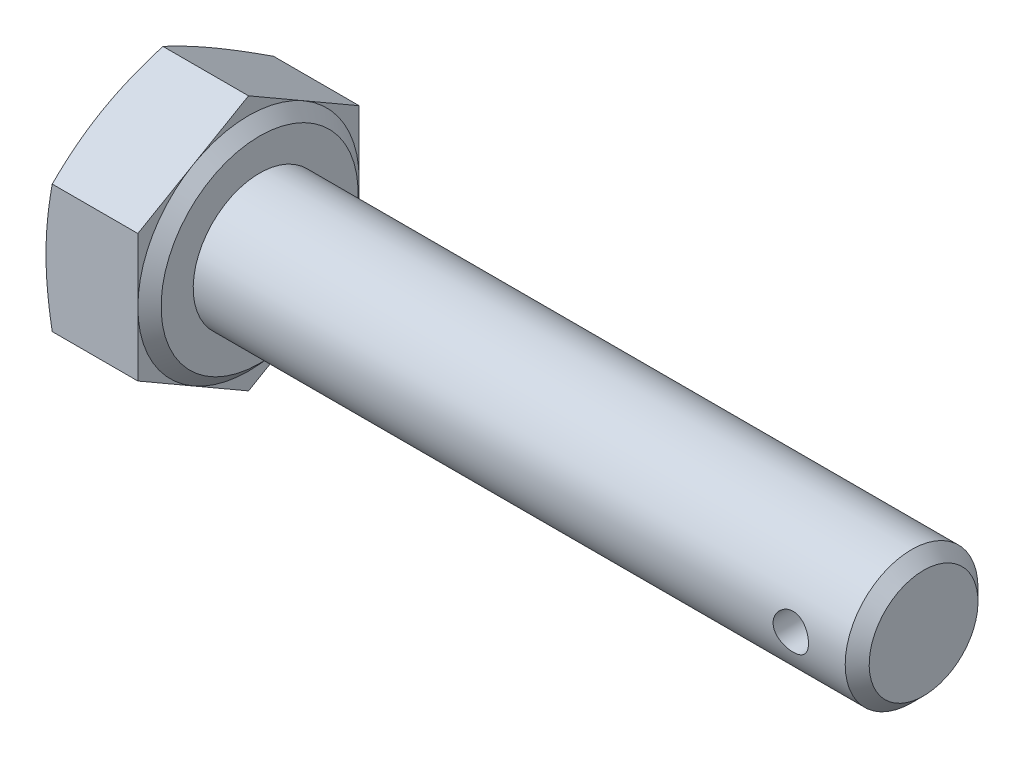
from build123d import *

# Parameters (mm, degrees)
BASEHEAD_DEPTH  = 4.15
SKETCH3_R       = 3
BASEBODY_DEPTH  = 30
CHAMFER1_SIZE   = 0.5415
HOLE_DEPTH      = 36.481767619
HOLE_DEPTH_BACK = 36.481767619
SKETCH5_R       = 0.8


with BuildPart() as part:
    # Sketch-BaseHead → BaseHead (new body)
    with BuildSketch(Plane(origin=(0, 0, 0), x_dir=(0, 0, -1), z_dir=(1, 0, 0))):
        Polygon((0, -5.773502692), (5, -2.886751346), (5, 2.886751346), (0, 5.773502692), (-5, 2.886751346), (-5, -2.886751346), align=None)
    extrude(amount=BASEHEAD_DEPTH)

    # Sketch4 → HeadChamfer (revolve, cut)
    with BuildSketch(Plane(origin=(-0.264637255, -5.916896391, 0), x_dir=(0, 1, 0), z_dir=(0, 0, 1))):
        Polygon((11.690399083, -0.264637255), (10.916896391, -0.264637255), (11.690399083, -0.546169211), align=None)
    revolve(axis=Axis((-4.001564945, 0, 0), (1, 0, 0)), mode=Mode.SUBTRACT)

    # Sketch1 → Revolve1 (revolve)
    with BuildSketch(Plane(origin=(0, 0, 0), x_dir=(1, 0, 0), z_dir=(0, 1, 0)), mode=Mode.PRIVATE) as revolve1_sk:
        Polygon((4.15, 0), (4.65, 0), (4.65, 4.45), (4.15, 5), align=None)
    revolve(revolve1_sk.sketch.rotate(Axis((-4.001564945, 0, 0), (1, 0, 0)), 270), axis=Axis((-4.001564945, 0, 0), (1, 0, 0)))

    # Sketch3 → BaseBody (add)
    with BuildSketch(Plane(origin=(4.65, 0, 0), x_dir=(0, 0, -1), z_dir=(1, 0, 0))):
        with Locations(Location((0, 0, 0), (0, 0, 270))):
            Circle(SKETCH3_R)
    extrude(amount=BASEBODY_DEPTH)

    # Chamfer1
    chamfer1_edges = [part.edges().sort_by_distance(p)[0] for p in [
        (34.65, 3, 0),
    ]]
    chamfer(chamfer1_edges, length=CHAMFER1_SIZE)

    # Sketch5 → Hole (cut, two sides: drawn at the far end of the back side and taken through both)
    with BuildSketch(Plane.XY.offset(-HOLE_DEPTH_BACK)):
        with Locations((31.65, 0)):
            Circle(SKETCH5_R)
    extrude(amount=HOLE_DEPTH + HOLE_DEPTH_BACK, mode=Mode.SUBTRACT)


solid = part.part
